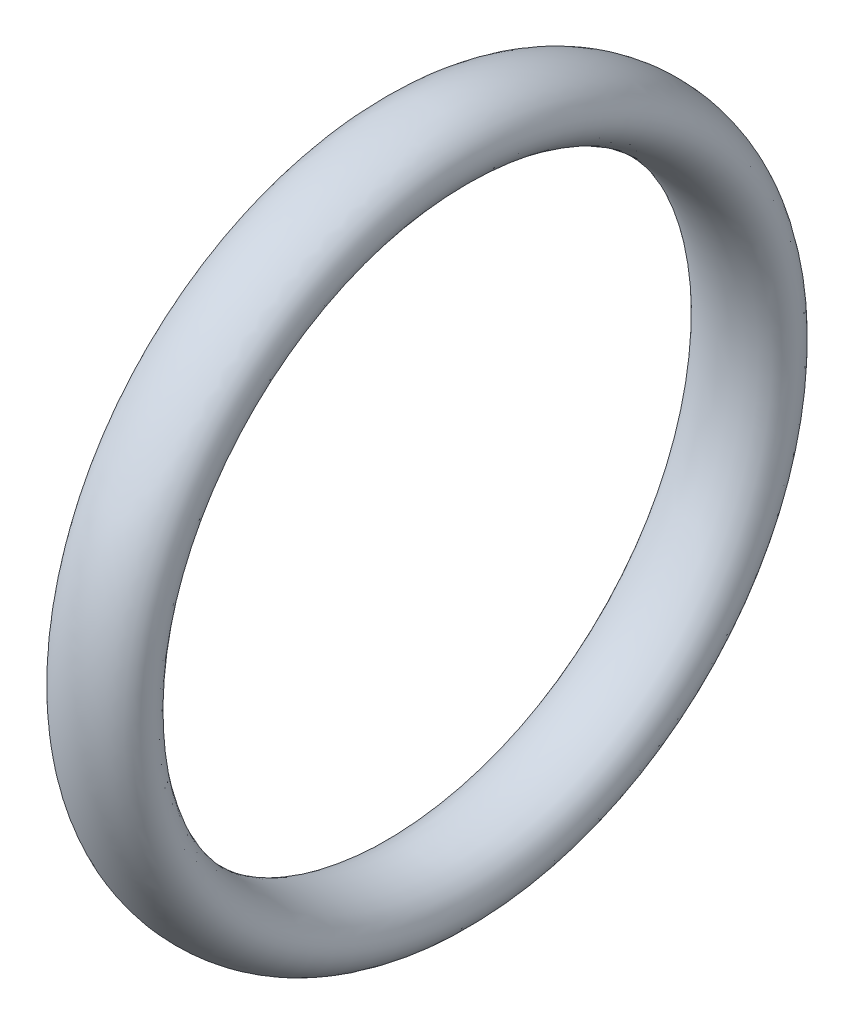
from build123d import *

# Parameters (mm, degrees)
ESQUISSE1_RX = 1.5
ESQUISSE1_RY = 1


with BuildPart() as part:
    # Esquisse1 → R_volution1 (revolve)
    with BuildSketch(Plane.XY):
        with Locations((0, 10)):
            Ellipse(ESQUISSE1_RX, ESQUISSE1_RY)
    revolve(axis=Axis((0, 0, 0), (1, 0, 0)))


solid = part.part
